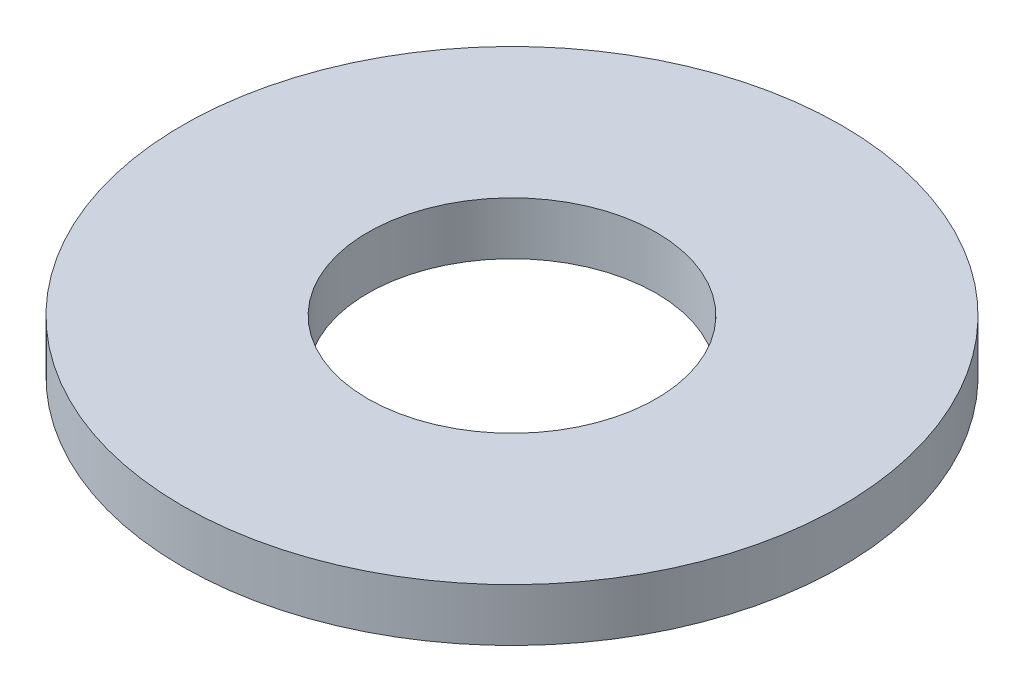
from build123d import *

# Parameters (mm, degrees)
SKETCH1_R          = 3.175
BASE_EXTRUDE_DEPTH = 0.508
CUT_EXTRUDE1_REACH = 6.519
SKETCH2_R          = 1.3890625


with BuildPart() as part:
    # Sketch1 → Base-Extrude (new body)
    with BuildSketch(Plane(origin=(0, 0, 0), x_dir=(1, 0, 0), z_dir=(0, 1, 0))):
        with Locations(Location((0, 0, 0), (0, 0, 270))):
            Circle(SKETCH1_R)
    extrude(amount=BASE_EXTRUDE_DEPTH)

    # Sketch2 → Cut-Extrude1 (cut, up to next)
    with BuildSketch(Plane(origin=(0, 0.508, 0), x_dir=(-1, 0, 0), z_dir=(0, 1, 0)), mode=Mode.PRIVATE) as cut_extrude1_sk1:
        with Locations(Location((0, 0, 0), (0, 0, 90))):
            Circle(SKETCH2_R)
    cut_extrude1_tool1 = extrude(cut_extrude1_sk1.sketch, amount=-CUT_EXTRUDE1_REACH, mode=Mode.PRIVATE) & part.part
    add(cut_extrude1_tool1.solids().sort_by_distance((0, 0.508, 0))[0], mode=Mode.SUBTRACT)


solid = part.part
